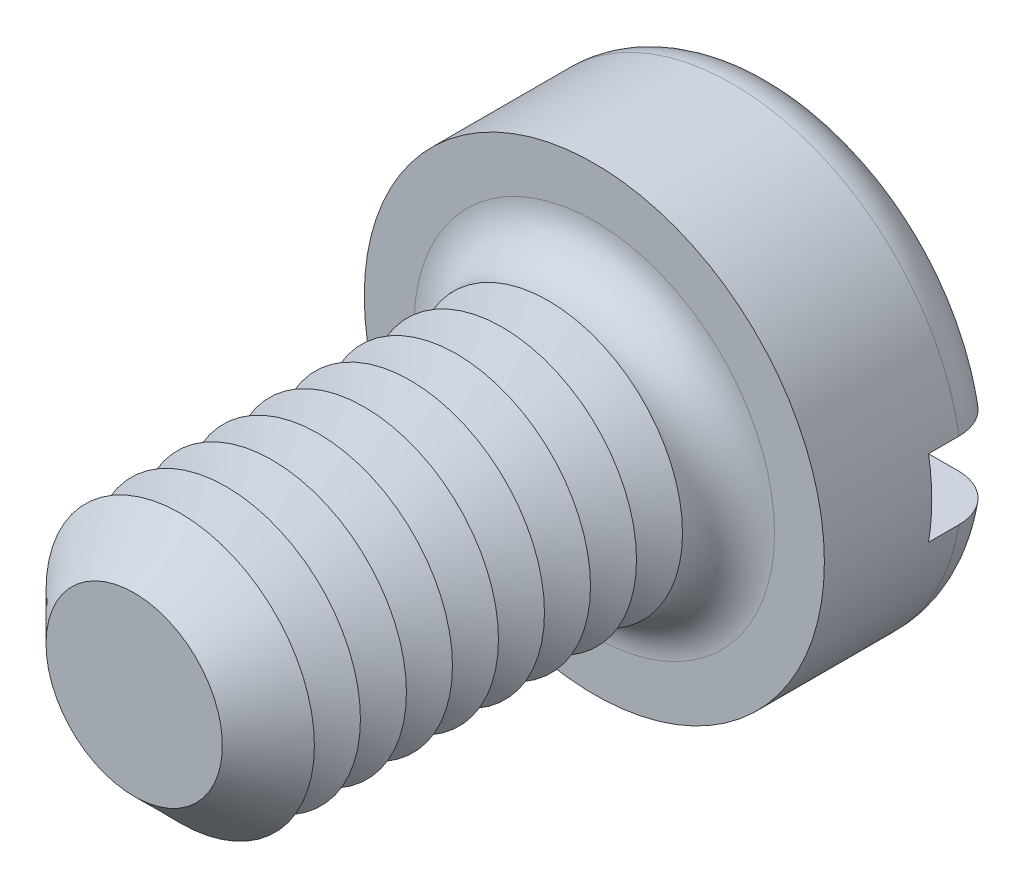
from build123d import *

# Parameters (mm, degrees)
SKETCH3_R           = 3
BOSS_EXTRUDE2_DEPTH = 2.4
SKETCH4_R           = 1.75
BOSS_EXTRUDE3_DEPTH = 6
FILLET1_R           = 0.6
CHAMFER1_SIZE       = 0.6
LPATTERN1_COUNT     = 8
LPATTERN1_PITCH     = 0.6
SKETCH8_W           = 6
SKETCH8_H           = 1
CUT_EXTRUDE1_DEPTH  = 1


with BuildPart() as part:
    # Sketch3 → Boss-Extrude2 (new body)
    with BuildSketch(Plane.XY):
        Circle(SKETCH3_R)
    extrude(amount=-BOSS_EXTRUDE2_DEPTH)

    # Sketch4 → Boss-Extrude3 (add)
    with BuildSketch(Plane.XY):
        Circle(SKETCH4_R)
    extrude(amount=BOSS_EXTRUDE3_DEPTH)

    # Fillet1
    fillet1_edges = [part.edges().sort_by_distance(p)[0] for p in [
        (-3, 0, -2.4),
        (-1.75, 0, 0),
    ]]
    fillet(fillet1_edges, radius=FILLET1_R)

    # Chamfer1
    chamfer1_edges = [part.edges().sort_by_distance(p)[0] for p in [
        (-1.75, 0, 6),
    ]]
    chamfer(chamfer1_edges, length=CHAMFER1_SIZE)

    # Sketch6 → Cut-Revolve1 (revolve, cut)
    with BuildSketch(Plane(origin=(0, 0, 0), x_dir=(0, 0, -1), z_dir=(1, 0, 0)), mode=Mode.PRIVATE) as cut_revolve1_sk:
        Polygon((-0.6, 1.75), (-0.9, 1.230384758), (-1.2, 1.75), align=None)
    cut_revolve1 = revolve(cut_revolve1_sk.sketch.rotate(Axis((0, 0, -1.694361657), (0, 0, 1)), 90), axis=Axis((0, 0, -1.694361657), (0, 0, 1)), mode=Mode.SUBTRACT)

    # LPattern1: Cut-Revolve1 ×8
    with Locations(*[(0, 0, i * LPATTERN1_PITCH) for i in range(1, LPATTERN1_COUNT)]):
        add(cut_revolve1, mode=Mode.SUBTRACT)

    # Sketch8 → Cut-Extrude1 (cut)
    with BuildSketch(Plane(origin=(0, 0, -2.4), x_dir=(-1, 0, 0), z_dir=(0, 0, -1))):
        Rectangle(SKETCH8_W, SKETCH8_H)
    extrude(amount=-CUT_EXTRUDE1_DEPTH, mode=Mode.SUBTRACT)


solid = part.part
